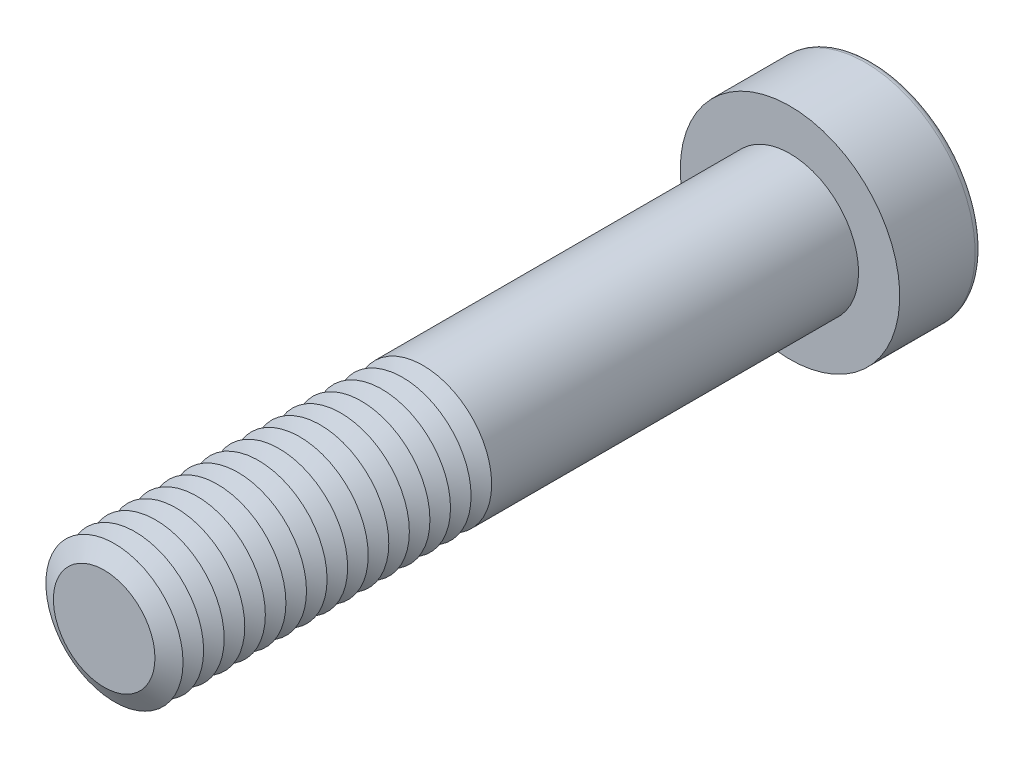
from build123d import *

# Parameters (mm, degrees)
SKETCH1_R           = 5
BOSS_EXTRUDE1_DEPTH = 50
SKETCH2_R           = 8
BOSS_EXTRUDE2_DEPTH = 6
CUT_EXTRUDE1_DEPTH  = 5.25
FILLET1_R           = 0.5
LPATTERN1_COUNT     = 16
LPATTERN1_PITCH     = 1.5


with BuildPart() as part:
    # Sketch1 → Boss-Extrude1 (new body)
    with BuildSketch(Plane.XY):
        Circle(SKETCH1_R)
    extrude(amount=BOSS_EXTRUDE1_DEPTH)

    # Sketch2 → Boss-Extrude2 (add)
    with BuildSketch(Plane(origin=(0, 0, 0), x_dir=(-1, 0, 0), z_dir=(0, 0, -1))):
        Circle(SKETCH2_R)
    extrude(amount=BOSS_EXTRUDE2_DEPTH)

    # Sketch3 → Cut-Extrude1 (cut)
    with BuildSketch(Plane(origin=(0, 0, -6), x_dir=(-1, 0, 0), z_dir=(0, 0, -1))):
        Polygon((-2.020725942, 3.5), (-4.041451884, 0), (-2.020725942, -3.5), (2.020725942, -3.5), (4.041451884, 0), (2.020725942, 3.5), align=None)
    extrude(amount=-CUT_EXTRUDE1_DEPTH, mode=Mode.SUBTRACT)

    # Fillet1
    fillet1_edges = [part.edges().sort_by_distance(p)[0] for p in [
        (8, 0, -6),
    ]]
    fillet(fillet1_edges, radius=FILLET1_R)

    # Cut-Extrude2 cone 1 section (on through the dimple's axis) → Cut-Extrude2 (revolve, cut)
    with BuildSketch(Plane(origin=(0, 0, -0.75), x_dir=(0, 1, 0), z_dir=(1, 0, 0))):
        Polygon((0, 0), (3.5, 0), (0, 2.020725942), align=None)
    revolve(axis=Axis((0, 0, -0.75), (0, 0, 1)), mode=Mode.SUBTRACT)

    # Cut-Extrude3 cone 1 section (on through the dimple's axis) → Cut-Extrude3 (revolve, cut)
    with BuildSketch(Plane(origin=(0, 0, -6), x_dir=(0, 1, 0), z_dir=(1, 0, 0))):
        Polygon((0, 0), (4.041451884, 0), (0, 1.082903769), align=None)
    revolve(axis=Axis((0, 0, -6), (0, 0, 1)), mode=Mode.SUBTRACT)

    # Sketch7 → Cut-Revolve1 (revolve, cut)
    with BuildSketch(Plane(origin=(0, 0, 0), x_dir=(0, 0, -1), z_dir=(1, 0, 0)), mode=Mode.PRIVATE) as cut_revolve1_sk:
        Polygon((-50, 3.700961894), (-49.25, 5), (-50.75, 5), align=None)
    cut_revolve1 = revolve(cut_revolve1_sk.sketch.rotate(Axis((0, 0, 50), (0, 0, -1)), 90), axis=Axis((0, 0, 50), (0, 0, -1)), mode=Mode.SUBTRACT)

    # LPattern1: Cut-Revolve1 ×16
    with Locations(*[(0, 0, -i * LPATTERN1_PITCH) for i in range(1, LPATTERN1_COUNT)]):
        add(cut_revolve1, mode=Mode.SUBTRACT)


solid = part.part
